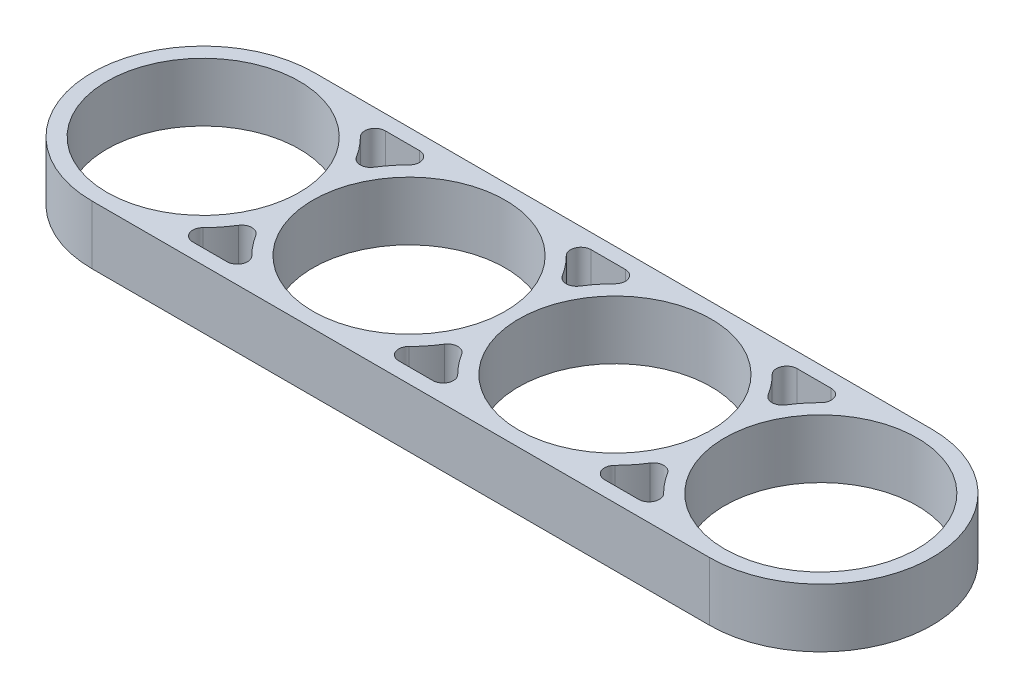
from build123d import *

# Parameters (mm, degrees)
SKIZZE1_R                       = 9.35
AUFSATZ_LINEAR_AUSTRAGEN1_DEPTH = 5.7


with BuildPart() as part:
    # Skizze1 → Aufsatz-Linear austragen1 (new body)
    with BuildSketch(Plane(origin=(0, 0, 0), x_dir=(1, 0, 0), z_dir=(0, 1, 0))):
        with BuildLine():
            Line((-34.596637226, 10.8), (25.403362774, 10.8))
            ThreePointArc((25.403362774, 10.8), (36.203362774, 0), (25.403362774, -10.8))
            Line((25.403362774, -10.8), (-34.596637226, -10.8))
            ThreePointArc((-34.596637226, -10.8), (-45.396637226, 0), (-34.596637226, 10.8))
        make_face()
        with Locations(Location((-34.596637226, 0, 0), (0, 0, 270))):
            Circle(SKIZZE1_R, mode=Mode.SUBTRACT)
        with Locations(Location((-14.596637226, 0, 0), (0, 0, 270))):
            Circle(SKIZZE1_R, mode=Mode.SUBTRACT)
        with Locations(Location((5.403362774, 0, 0), (0, 0, 270))):
            Circle(SKIZZE1_R, mode=Mode.SUBTRACT)
        with Locations(Location((25.403362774, 0, 0), (0, 0, 270))):
            Circle(SKIZZE1_R, mode=Mode.SUBTRACT)
        with BuildLine():
            Line((-26.258921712, 9.35), (-22.93435274, 9.35))
            ThreePointArc((-22.93435274, 9.35), (-22.010332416, 8.732343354), (-22.22776668, 7.642372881))
            ThreePointArc((-22.22776668, 7.642372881), (-23.042584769, 6.730970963), (-23.749179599, 5.733320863))
            ThreePointArc((-23.749179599, 5.733320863), (-24.596637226, 5.264183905), (-25.444094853, 5.733320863))
            ThreePointArc((-25.444094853, 5.733320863), (-26.150689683, 6.730970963), (-26.965507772, 7.642372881))
            ThreePointArc((-26.965507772, 7.642372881), (-27.182942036, 8.732343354), (-26.258921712, 9.35))
        make_face(mode=Mode.SUBTRACT)
        with BuildLine():
            Line((-26.258921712, -9.35), (-22.93435274, -9.35))
            ThreePointArc((-22.93435274, -9.35), (-22.010332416, -8.732343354), (-22.22776668, -7.642372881))
            ThreePointArc((-22.22776668, -7.642372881), (-23.042584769, -6.730970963), (-23.749179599, -5.733320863))
            ThreePointArc((-23.749179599, -5.733320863), (-24.596637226, -5.264183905), (-25.444094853, -5.733320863))
            ThreePointArc((-25.444094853, -5.733320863), (-26.150689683, -6.730970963), (-26.965507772, -7.642372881))
            ThreePointArc((-26.965507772, -7.642372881), (-27.182942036, -8.732343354), (-26.258921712, -9.35))
        make_face(mode=Mode.SUBTRACT)
        with BuildLine():
            Line((-6.258921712, -9.35), (-2.93435274, -9.35))
            ThreePointArc((-2.93435274, -9.35), (-2.010332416, -8.732343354), (-2.22776668, -7.642372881))
            ThreePointArc((-2.22776668, -7.642372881), (-3.042584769, -6.730970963), (-3.749179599, -5.733320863))
            ThreePointArc((-3.749179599, -5.733320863), (-4.596637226, -5.264183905), (-5.444094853, -5.733320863))
            ThreePointArc((-5.444094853, -5.733320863), (-6.150689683, -6.730970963), (-6.965507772, -7.642372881))
            ThreePointArc((-6.965507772, -7.642372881), (-7.182942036, -8.732343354), (-6.258921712, -9.35))
        make_face(mode=Mode.SUBTRACT)
        with BuildLine():
            Line((13.741078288, -9.35), (17.06564726, -9.35))
            ThreePointArc((17.06564726, -9.35), (17.989667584, -8.732343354), (17.77223332, -7.642372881))
            ThreePointArc((17.77223332, -7.642372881), (16.957415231, -6.730970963), (16.250820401, -5.733320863))
            ThreePointArc((16.250820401, -5.733320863), (15.403362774, -5.264183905), (14.555905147, -5.733320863))
            ThreePointArc((14.555905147, -5.733320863), (13.849310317, -6.730970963), (13.034492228, -7.642372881))
            ThreePointArc((13.034492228, -7.642372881), (12.817057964, -8.732343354), (13.741078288, -9.35))
        make_face(mode=Mode.SUBTRACT)
        with BuildLine():
            Line((13.741078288, 9.35), (17.06564726, 9.35))
            ThreePointArc((17.06564726, 9.35), (17.989667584, 8.732343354), (17.77223332, 7.642372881))
            ThreePointArc((17.77223332, 7.642372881), (16.957415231, 6.730970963), (16.250820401, 5.733320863))
            ThreePointArc((16.250820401, 5.733320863), (15.403362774, 5.264183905), (14.555905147, 5.733320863))
            ThreePointArc((14.555905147, 5.733320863), (13.849310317, 6.730970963), (13.034492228, 7.642372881))
            ThreePointArc((13.034492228, 7.642372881), (12.817057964, 8.732343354), (13.741078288, 9.35))
        make_face(mode=Mode.SUBTRACT)
        with BuildLine():
            Line((-6.258921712, 9.35), (-2.93435274, 9.35))
            ThreePointArc((-2.93435274, 9.35), (-2.010332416, 8.732343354), (-2.22776668, 7.642372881))
            ThreePointArc((-2.22776668, 7.642372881), (-3.042584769, 6.730970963), (-3.749179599, 5.733320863))
            ThreePointArc((-3.749179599, 5.733320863), (-4.596637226, 5.264183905), (-5.444094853, 5.733320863))
            ThreePointArc((-5.444094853, 5.733320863), (-6.150689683, 6.730970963), (-6.965507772, 7.642372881))
            ThreePointArc((-6.965507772, 7.642372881), (-7.182942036, 8.732343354), (-6.258921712, 9.35))
        make_face(mode=Mode.SUBTRACT)
    extrude(amount=AUFSATZ_LINEAR_AUSTRAGEN1_DEPTH)


solid = part.part
